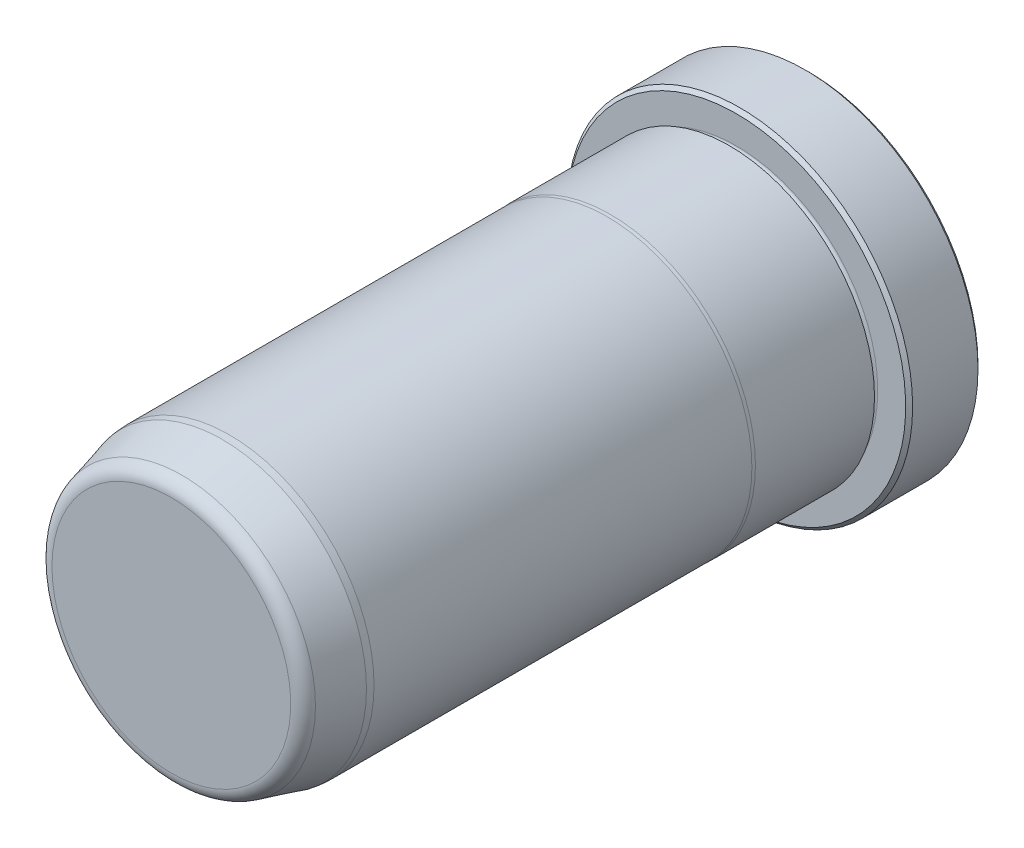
ISO-10303-21;
HEADER;
FILE_DESCRIPTION(('STEP AP214'),'2;1');
FILE_NAME('part.step','',(''),(''),'','','');
FILE_SCHEMA(('AUTOMOTIVE_DESIGN { 1 0 10303 214 1 1 1 1 }'));
ENDSEC;
DATA;
#1=APPLICATION_CONTEXT('core data for automotive mechanical design processes');
#2=APPLICATION_PROTOCOL_DEFINITION('international standard','automotive_design',2000,#1);
#3=PRODUCT_CONTEXT('',#1,'mechanical');
#4=PRODUCT('Part','Part','',(#3));
#5=PRODUCT_RELATED_PRODUCT_CATEGORY('part','',(#4));
#6=PRODUCT_DEFINITION_FORMATION('','',#4);
#7=PRODUCT_DEFINITION_CONTEXT('part definition',#1,'design');
#8=PRODUCT_DEFINITION('design','',#6,#7);
#9=PRODUCT_DEFINITION_SHAPE('','',#8);
#10=(LENGTH_UNIT() NAMED_UNIT(*) SI_UNIT(.MILLI.,.METRE.));
#11=(NAMED_UNIT(*) PLANE_ANGLE_UNIT() SI_UNIT($,.RADIAN.));
#12=(NAMED_UNIT(*) SI_UNIT($,.STERADIAN.) SOLID_ANGLE_UNIT());
#13=UNCERTAINTY_MEASURE_WITH_UNIT(LENGTH_MEASURE(1.E-05),#10,'distance_accuracy_value','');
#14=(GEOMETRIC_REPRESENTATION_CONTEXT(3) GLOBAL_UNCERTAINTY_ASSIGNED_CONTEXT((#13)) GLOBAL_UNIT_ASSIGNED_CONTEXT((#10,
#11,#12)) REPRESENTATION_CONTEXT('',''));
#15=CARTESIAN_POINT('',(0.,0.,0.));
#16=DIRECTION('',(0.,0.,1.));
#17=DIRECTION('',(1.,0.,0.));
#18=AXIS2_PLACEMENT_3D('',#15,#16,#17);
#19=CARTESIAN_POINT('',(0.,0.,0.));
#20=DIRECTION('',(0.,0.,1.));
#21=DIRECTION('',(1.,0.,0.));
#22=AXIS2_PLACEMENT_3D('',#19,#20,#21);
#23=PLANE('',#22);
#24=CARTESIAN_POINT('',(0.,0.,0.));
#25=DIRECTION('',(0.,0.,1.));
#26=DIRECTION('',(1.,0.,0.));
#27=AXIS2_PLACEMENT_3D('',#24,#25,#26);
#28=CIRCLE('',#27,18.542);
#29=CARTESIAN_POINT('',(18.542,0.,0.));
#30=VERTEX_POINT('',#29);
#31=EDGE_CURVE('E37',#30,#30,#28,.F.);
#32=ORIENTED_EDGE('',*,*,#31,.T.);
#33=EDGE_LOOP('',(#32));
#34=FACE_BOUND('',#33,.T.);
#35=ADVANCED_FACE('F30',(#34),#23,.F.);
#36=CARTESIAN_POINT('',(0.,0.,0.));
#37=DIRECTION('',(0.,0.,1.));
#38=DIRECTION('',(1.,0.,0.));
#39=AXIS2_PLACEMENT_3D('',#36,#37,#38);
#40=CYLINDRICAL_SURFACE('',#39,18.923);
#41=CARTESIAN_POINT('',(0.,0.,0.381000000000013));
#42=DIRECTION('',(0.,0.,1.));
#43=DIRECTION('',(1.,0.,0.));
#44=AXIS2_PLACEMENT_3D('',#41,#42,#43);
#45=CIRCLE('',#44,18.923);
#46=CARTESIAN_POINT('',(18.923,0.,0.381000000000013));
#47=VERTEX_POINT('',#46);
#48=EDGE_CURVE('E41',#47,#47,#45,.T.);
#49=ORIENTED_EDGE('',*,*,#48,.T.);
#50=EDGE_LOOP('',(#49));
#51=FACE_BOUND('',#50,.T.);
#52=CARTESIAN_POINT('',(0.,0.,7.5438));
#53=DIRECTION('',(0.,0.,-1.));
#54=DIRECTION('',(-1.,0.,0.));
#55=AXIS2_PLACEMENT_3D('',#52,#53,#54);
#56=CIRCLE('',#55,18.923);
#57=CARTESIAN_POINT('',(-18.923,0.,7.5438));
#58=VERTEX_POINT('',#57);
#59=EDGE_CURVE('E45',#58,#58,#56,.T.);
#60=ORIENTED_EDGE('',*,*,#59,.T.);
#61=EDGE_LOOP('',(#60));
#62=FACE_BOUND('',#61,.T.);
#63=ADVANCED_FACE('F118',(#51,#62),#40,.T.);
#64=CARTESIAN_POINT('',(0.,18.923,7.9248));
#65=DIRECTION('',(0.,0.,-1.));
#66=DIRECTION('',(-1.,0.,0.));
#67=AXIS2_PLACEMENT_3D('',#64,#65,#66);
#68=PLANE('',#67);
#69=CARTESIAN_POINT('',(0.,0.,7.9248));
#70=DIRECTION('',(0.,0.,-1.));
#71=DIRECTION('',(-1.,0.,0.));
#72=AXIS2_PLACEMENT_3D('',#69,#70,#71);
#73=CIRCLE('',#72,18.542);
#74=CARTESIAN_POINT('',(-18.542,0.,7.9248));
#75=VERTEX_POINT('',#74);
#76=EDGE_CURVE('E10',#75,#75,#73,.F.);
#77=ORIENTED_EDGE('',*,*,#76,.T.);
#78=EDGE_LOOP('',(#77));
#79=FACE_BOUND('',#78,.T.);
#80=CARTESIAN_POINT('',(0.,0.,7.9248));
#81=DIRECTION('',(0.,0.,1.));
#82=DIRECTION('',(1.,0.,0.));
#83=AXIS2_PLACEMENT_3D('',#80,#81,#82);
#84=CIRCLE('',#83,15.4813);
#85=CARTESIAN_POINT('',(15.4813,0.,7.9248));
#86=VERTEX_POINT('',#85);
#87=EDGE_CURVE('E56',#86,#86,#84,.T.);
#88=ORIENTED_EDGE('',*,*,#87,.F.);
#89=EDGE_LOOP('',(#88));
#90=FACE_BOUND('',#89,.T.);
#91=ADVANCED_FACE('F113',(#79,#90),#68,.F.);
#92=CARTESIAN_POINT('',(0.,0.,8.3058));
#93=DIRECTION('',(0.,0.,1.));
#94=DIRECTION('',(1.,0.,0.));
#95=AXIS2_PLACEMENT_3D('',#92,#93,#94);
#96=TOROIDAL_SURFACE('',#95,15.4813,0.381000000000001);
#97=CARTESIAN_POINT('',(0.,0.,8.6868));
#98=DIRECTION('',(0.,0.,1.));
#99=DIRECTION('',(1.,0.,0.));
#100=AXIS2_PLACEMENT_3D('',#97,#98,#99);
#101=CIRCLE('',#100,15.4813);
#102=CARTESIAN_POINT('',(15.4813,0.,8.6868));
#103=VERTEX_POINT('',#102);
#104=EDGE_CURVE('E59',#103,#103,#101,.T.);
#105=ORIENTED_EDGE('',*,*,#104,.F.);
#106=EDGE_LOOP('',(#105));
#107=FACE_BOUND('',#106,.T.);
#108=ORIENTED_EDGE('',*,*,#87,.T.);
#109=EDGE_LOOP('',(#108));
#110=FACE_BOUND('',#109,.T.);
#111=ADVANCED_FACE('F107',(#107,#110),#96,.F.);
#112=CARTESIAN_POINT('',(0.,15.4813,8.6868));
#113=DIRECTION('',(0.,0.,1.));
#114=DIRECTION('',(1.,0.,0.));
#115=AXIS2_PLACEMENT_3D('',#112,#113,#114);
#116=PLANE('',#115);
#117=CARTESIAN_POINT('',(0.,0.,8.6868));
#118=DIRECTION('',(0.,0.,1.));
#119=DIRECTION('',(1.,0.,0.));
#120=AXIS2_PLACEMENT_3D('',#117,#118,#119);
#121=CIRCLE('',#120,15.8877);
#122=CARTESIAN_POINT('',(15.8877,0.,8.6868));
#123=VERTEX_POINT('',#122);
#124=EDGE_CURVE('E62',#123,#123,#121,.T.);
#125=ORIENTED_EDGE('',*,*,#124,.F.);
#126=EDGE_LOOP('',(#125));
#127=FACE_BOUND('',#126,.T.);
#128=ORIENTED_EDGE('',*,*,#104,.T.);
#129=EDGE_LOOP('',(#128));
#130=FACE_BOUND('',#129,.T.);
#131=ADVANCED_FACE('F101',(#127,#130),#116,.F.);
#132=CARTESIAN_POINT('',(0.,0.,0.));
#133=DIRECTION('',(0.,0.,1.));
#134=DIRECTION('',(1.,0.,0.));
#135=AXIS2_PLACEMENT_3D('',#132,#133,#134);
#136=CYLINDRICAL_SURFACE('',#135,15.8877);
#137=CARTESIAN_POINT('',(0.,0.,21.7347630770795));
#138=DIRECTION('',(0.,0.,1.));
#139=DIRECTION('',(1.,0.,0.));
#140=AXIS2_PLACEMENT_3D('',#137,#138,#139);
#141=CIRCLE('',#140,15.8877);
#142=CARTESIAN_POINT('',(15.8877,0.,21.7347630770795));
#143=VERTEX_POINT('',#142);
#144=EDGE_CURVE('E65',#143,#143,#141,.T.);
#145=ORIENTED_EDGE('',*,*,#144,.F.);
#146=EDGE_LOOP('',(#145));
#147=FACE_BOUND('',#146,.T.);
#148=ORIENTED_EDGE('',*,*,#124,.T.);
#149=EDGE_LOOP('',(#148));
#150=FACE_BOUND('',#149,.T.);
#151=ADVANCED_FACE('F95',(#147,#150),#136,.T.);
#152=CARTESIAN_POINT('',(0.,0.,21.7347630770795));
#153=DIRECTION('',(0.,0.,-1.));
#154=DIRECTION('',(-1.,0.,0.));
#155=AXIS2_PLACEMENT_3D('',#152,#153,#154);
#156=CONICAL_SURFACE('',#155,15.8877,0.0698131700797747);
#157=CARTESIAN_POINT('',(0.,0.,22.098));
#158=DIRECTION('',(0.,0.,1.));
#159=DIRECTION('',(1.,0.,0.));
#160=AXIS2_PLACEMENT_3D('',#157,#158,#159);
#161=CIRCLE('',#160,15.8623);
#162=CARTESIAN_POINT('',(15.8623,0.,22.098));
#163=VERTEX_POINT('',#162);
#164=EDGE_CURVE('E68',#163,#163,#161,.T.);
#165=ORIENTED_EDGE('',*,*,#164,.F.);
#166=EDGE_LOOP('',(#165));
#167=FACE_BOUND('',#166,.T.);
#168=ORIENTED_EDGE('',*,*,#144,.T.);
#169=EDGE_LOOP('',(#168));
#170=FACE_BOUND('',#169,.T.);
#171=ADVANCED_FACE('F89',(#167,#170),#156,.T.);
#172=CARTESIAN_POINT('',(0.,0.,0.));
#173=DIRECTION('',(0.,0.,1.));
#174=DIRECTION('',(1.,0.,0.));
#175=AXIS2_PLACEMENT_3D('',#172,#173,#174);
#176=CYLINDRICAL_SURFACE('',#175,15.8623);
#177=CARTESIAN_POINT('',(0.,0.,63.5));
#178=DIRECTION('',(0.,0.,1.));
#179=DIRECTION('',(1.,0.,0.));
#180=AXIS2_PLACEMENT_3D('',#177,#178,#179);
#181=CIRCLE('',#180,15.8623);
#182=CARTESIAN_POINT('',(15.8623,0.,63.5));
#183=VERTEX_POINT('',#182);
#184=EDGE_CURVE('E71',#183,#183,#181,.T.);
#185=ORIENTED_EDGE('',*,*,#184,.F.);
#186=EDGE_LOOP('',(#185));
#187=FACE_BOUND('',#186,.T.);
#188=ORIENTED_EDGE('',*,*,#164,.T.);
#189=EDGE_LOOP('',(#188));
#190=FACE_BOUND('',#189,.T.);
#191=ADVANCED_FACE('F83',(#187,#190),#176,.T.);
#192=CARTESIAN_POINT('',(0.,0.,63.5));
#193=DIRECTION('',(0.,0.,-1.));
#194=DIRECTION('',(-1.,0.,0.));
#195=AXIS2_PLACEMENT_3D('',#192,#193,#194);
#196=CONICAL_SURFACE('',#195,15.8623,0.0872664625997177);
#197=CARTESIAN_POINT('',(0.,0.,64.262));
#198=DIRECTION('',(0.,0.,1.));
#199=DIRECTION('',(1.,0.,0.));
#200=AXIS2_PLACEMENT_3D('',#197,#198,#199);
#201=CIRCLE('',#200,15.7956336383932);
#202=CARTESIAN_POINT('',(15.7956336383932,0.,64.262));
#203=VERTEX_POINT('',#202);
#204=EDGE_CURVE('E74',#203,#203,#201,.T.);
#205=ORIENTED_EDGE('',*,*,#204,.F.);
#206=EDGE_LOOP('',(#205));
#207=FACE_BOUND('',#206,.T.);
#208=ORIENTED_EDGE('',*,*,#184,.T.);
#209=EDGE_LOOP('',(#208));
#210=FACE_BOUND('',#209,.T.);
#211=ADVANCED_FACE('F80',(#207,#210),#196,.T.);
#212=CARTESIAN_POINT('',(0.,0.,64.262));
#213=DIRECTION('',(0.,0.,-1.));
#214=DIRECTION('',(-1.,0.,0.));
#215=AXIS2_PLACEMENT_3D('',#212,#213,#214);
#216=CONICAL_SURFACE('',#215,15.7956336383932,0.26179938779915);
#217=CARTESIAN_POINT('',(0.,0.,68.6733752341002));
#218=DIRECTION('',(0.,0.,1.));
#219=DIRECTION('',(1.,0.,0.));
#220=AXIS2_PLACEMENT_3D('',#217,#218,#219);
#221=CIRCLE('',#220,14.6136092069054);
#222=CARTESIAN_POINT('',(14.6136092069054,0.,68.6733752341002));
#223=VERTEX_POINT('',#222);
#224=EDGE_CURVE('E50',#223,#223,#221,.F.);
#225=ORIENTED_EDGE('',*,*,#224,.T.);
#226=EDGE_LOOP('',(#225));
#227=FACE_BOUND('',#226,.T.);
#228=ORIENTED_EDGE('',*,*,#204,.T.);
#229=EDGE_LOOP('',(#228));
#230=FACE_BOUND('',#229,.T.);
#231=ADVANCED_FACE('F78',(#227,#230),#216,.T.);
#232=CARTESIAN_POINT('',(0.,14.2983335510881,69.85));
#233=DIRECTION('',(0.,0.,-1.));
#234=DIRECTION('',(-1.,0.,0.));
#235=AXIS2_PLACEMENT_3D('',#232,#233,#234);
#236=PLANE('',#235);
#237=CARTESIAN_POINT('',(0.,0.,69.85));
#238=DIRECTION('',(0.,0.,-1.));
#239=DIRECTION('',(-1.,0.,0.));
#240=AXIS2_PLACEMENT_3D('',#237,#238,#239);
#241=CIRCLE('',#240,13.0802019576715);
#242=CARTESIAN_POINT('',(-13.0802019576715,0.,69.85));
#243=VERTEX_POINT('',#242);
#244=EDGE_CURVE('E53',#243,#243,#241,.F.);
#245=ORIENTED_EDGE('',*,*,#244,.T.);
#246=EDGE_LOOP('',(#245));
#247=FACE_BOUND('',#246,.T.);
#248=ADVANCED_FACE('F133',(#247),#236,.F.);
#249=CARTESIAN_POINT('',(0.,0.,68.2625));
#250=DIRECTION('',(0.,0.,-1.));
#251=DIRECTION('',(-1.,0.,0.));
#252=AXIS2_PLACEMENT_3D('',#249,#250,#251);
#253=TOROIDAL_SURFACE('',#252,13.0802019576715,1.5875);
#254=ORIENTED_EDGE('',*,*,#224,.F.);
#255=EDGE_LOOP('',(#254));
#256=FACE_BOUND('',#255,.T.);
#257=ORIENTED_EDGE('',*,*,#244,.F.);
#258=EDGE_LOOP('',(#257));
#259=FACE_BOUND('',#258,.T.);
#260=ADVANCED_FACE('F130',(#256,#259),#253,.T.);
#261=CARTESIAN_POINT('',(0.,0.,0.381000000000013));
#262=DIRECTION('',(0.,0.,1.));
#263=DIRECTION('',(1.,0.,0.));
#264=AXIS2_PLACEMENT_3D('',#261,#262,#263);
#265=CONICAL_SURFACE('',#264,18.923,0.785398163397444);
#266=ORIENTED_EDGE('',*,*,#31,.F.);
#267=EDGE_LOOP('',(#266));
#268=FACE_BOUND('',#267,.T.);
#269=ORIENTED_EDGE('',*,*,#48,.F.);
#270=EDGE_LOOP('',(#269));
#271=FACE_BOUND('',#270,.T.);
#272=ADVANCED_FACE('F132',(#268,#271),#265,.T.);
#273=CARTESIAN_POINT('',(0.,0.,7.9248));
#274=DIRECTION('',(0.,0.,-1.));
#275=DIRECTION('',(-1.,0.,0.));
#276=AXIS2_PLACEMENT_3D('',#273,#274,#275);
#277=CONICAL_SURFACE('',#276,18.542,0.785398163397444);
#278=ORIENTED_EDGE('',*,*,#59,.F.);
#279=EDGE_LOOP('',(#278));
#280=FACE_BOUND('',#279,.T.);
#281=ORIENTED_EDGE('',*,*,#76,.F.);
#282=EDGE_LOOP('',(#281));
#283=FACE_BOUND('',#282,.T.);
#284=ADVANCED_FACE('F32',(#280,#283),#277,.T.);
#285=CLOSED_SHELL('',(#35,#63,#91,#111,#131,#151,#171,#191,#211,#231,#248,#260,#272,#284));
#286=MANIFOLD_SOLID_BREP('B2',#285);
#287=ADVANCED_BREP_SHAPE_REPRESENTATION('',(#18,#286),#14);
#288=SHAPE_DEFINITION_REPRESENTATION(#9,#287);
ENDSEC;
END-ISO-10303-21;
